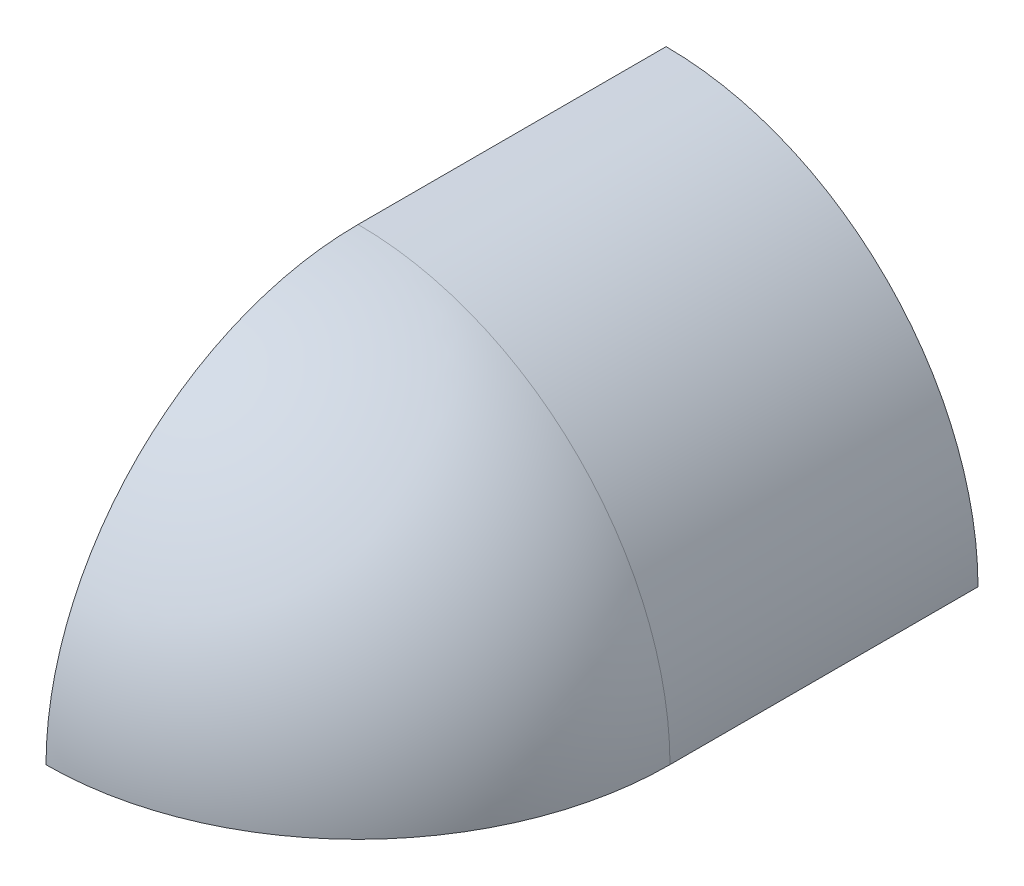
from build123d import *

# Parameters (mm, degrees)
REVOLVE_1_ANGLE = 90


with BuildPart() as part:
    # Sketch 1 → Revolve 1 (revolve)
    with BuildSketch(Plane(origin=(0, 0, 0), x_dir=(0, 0, -1), z_dir=(1, 0, 0))):
        with BuildLine():
            Line((-40.158085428, 0), (41.284681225, 0))
            Line((41.284681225, 0), (41.284681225, 40.961236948))
            Line((41.284681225, 40.961236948), (0.831767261, 40.961236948))
            ThreePointArc((0.831767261, 40.961236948), (-28.150698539, 28.97408737), (-40.158085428, 0))
        make_face()
    revolve(axis=Axis((0, 0, 51.081071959), (0, 0, -1)), revolution_arc=REVOLVE_1_ANGLE)


solid = part.part
